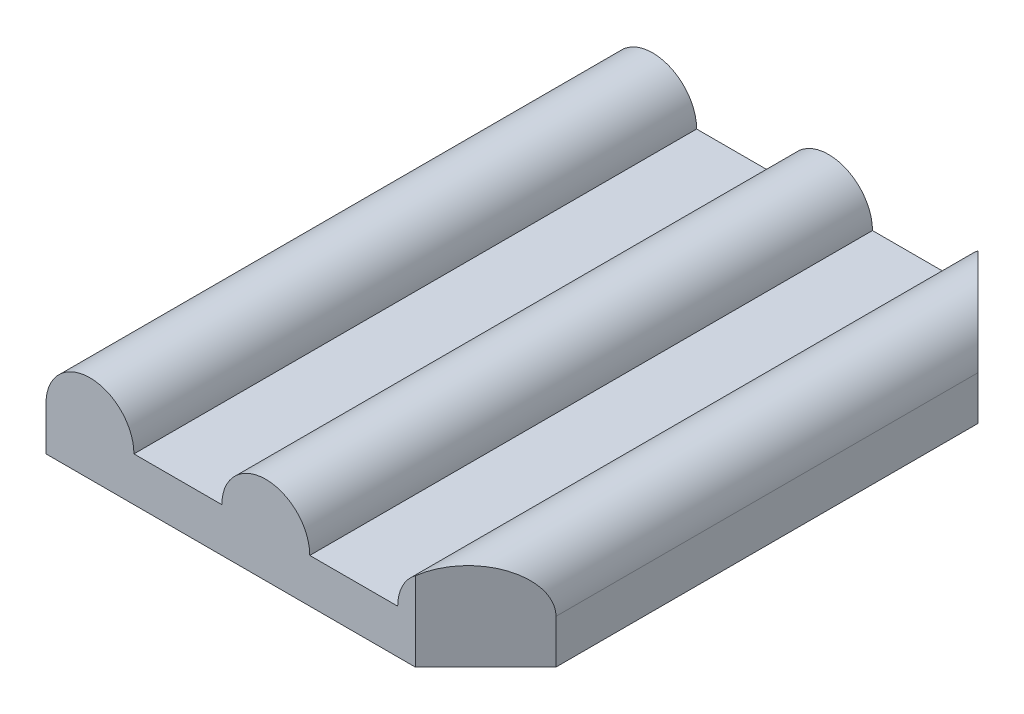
ISO-10303-21;
HEADER;
FILE_DESCRIPTION(('STEP AP214'),'2;1');
FILE_NAME('part.step','',(''),(''),'','','');
FILE_SCHEMA(('AUTOMOTIVE_DESIGN { 1 0 10303 214 1 1 1 1 }'));
ENDSEC;
DATA;
#1=APPLICATION_CONTEXT('core data for automotive mechanical design processes');
#2=APPLICATION_PROTOCOL_DEFINITION('international standard','automotive_design',2000,#1);
#3=PRODUCT_CONTEXT('',#1,'mechanical');
#4=PRODUCT('Part','Part','',(#3));
#5=PRODUCT_RELATED_PRODUCT_CATEGORY('part','',(#4));
#6=PRODUCT_DEFINITION_FORMATION('','',#4);
#7=PRODUCT_DEFINITION_CONTEXT('part definition',#1,'design');
#8=PRODUCT_DEFINITION('design','',#6,#7);
#9=PRODUCT_DEFINITION_SHAPE('','',#8);
#10=(LENGTH_UNIT() NAMED_UNIT(*) SI_UNIT(.MILLI.,.METRE.));
#11=(NAMED_UNIT(*) PLANE_ANGLE_UNIT() SI_UNIT($,.RADIAN.));
#12=(NAMED_UNIT(*) SI_UNIT($,.STERADIAN.) SOLID_ANGLE_UNIT());
#13=UNCERTAINTY_MEASURE_WITH_UNIT(LENGTH_MEASURE(1.E-05),#10,'distance_accuracy_value','');
#14=(GEOMETRIC_REPRESENTATION_CONTEXT(3) GLOBAL_UNCERTAINTY_ASSIGNED_CONTEXT((#13)) GLOBAL_UNIT_ASSIGNED_CONTEXT((#10,
#11,#12)) REPRESENTATION_CONTEXT('',''));
#15=CARTESIAN_POINT('',(0.,0.,0.));
#16=DIRECTION('',(0.,0.,1.));
#17=DIRECTION('',(1.,0.,0.));
#18=AXIS2_PLACEMENT_3D('',#15,#16,#17);
#19=CARTESIAN_POINT('',(10.,2.5,0.));
#20=DIRECTION('',(0.,0.,1.));
#21=DIRECTION('',(1.,0.,0.));
#22=AXIS2_PLACEMENT_3D('',#19,#20,#21);
#23=CYLINDRICAL_SURFACE('',#22,2.5);
#24=CARTESIAN_POINT('',(10.,2.5,30.5));
#25=DIRECTION('',(-0.707106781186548,0.,-0.707106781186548));
#26=DIRECTION('',(-0.707106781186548,0.,0.707106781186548));
#27=AXIS2_PLACEMENT_3D('',#24,#25,#26);
#28=ELLIPSE('',#27,3.53553390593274,2.5);
#29=CARTESIAN_POINT('',(8.5,4.5,32.));
#30=VERTEX_POINT('',#29);
#31=CARTESIAN_POINT('',(12.5,2.5,28.));
#32=VERTEX_POINT('',#31);
#33=EDGE_CURVE('E104',#30,#32,#28,.T.);
#34=ORIENTED_EDGE('',*,*,#33,.T.);
#35=DIRECTION('',(0.,0.,-1.));
#36=VECTOR('',#35,1.);
#37=CARTESIAN_POINT('',(12.5,2.5,0.));
#38=LINE('',#37,#36);
#39=CARTESIAN_POINT('',(12.5,2.5,4.));
#40=VERTEX_POINT('',#39);
#41=EDGE_CURVE('E102',#40,#32,#38,.F.);
#42=ORIENTED_EDGE('',*,*,#41,.F.);
#43=CARTESIAN_POINT('',(10.,2.5,1.5));
#44=DIRECTION('',(-0.707106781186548,0.,0.707106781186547));
#45=DIRECTION('',(0.707106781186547,0.,0.707106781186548));
#46=AXIS2_PLACEMENT_3D('',#43,#44,#45);
#47=ELLIPSE('',#46,3.53553390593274,2.5);
#48=CARTESIAN_POINT('',(8.5,4.5,0.));
#49=VERTEX_POINT('',#48);
#50=EDGE_CURVE('E19',#40,#49,#47,.T.);
#51=ORIENTED_EDGE('',*,*,#50,.T.);
#52=CARTESIAN_POINT('',(10.,2.5,0.));
#53=DIRECTION('',(0.,0.,1.));
#54=DIRECTION('',(1.,0.,0.));
#55=AXIS2_PLACEMENT_3D('',#52,#53,#54);
#56=CIRCLE('',#55,2.5);
#57=CARTESIAN_POINT('',(7.5,2.5,0.));
#58=VERTEX_POINT('',#57);
#59=EDGE_CURVE('E122',#49,#58,#56,.T.);
#60=ORIENTED_EDGE('',*,*,#59,.T.);
#61=DIRECTION('',(0.,0.,1.));
#62=VECTOR('',#61,1.);
#63=CARTESIAN_POINT('',(7.5,2.5,0.));
#64=LINE('',#63,#62);
#65=CARTESIAN_POINT('',(7.5,2.5,32.));
#66=VERTEX_POINT('',#65);
#67=EDGE_CURVE('E156',#66,#58,#64,.F.);
#68=ORIENTED_EDGE('',*,*,#67,.F.);
#69=CARTESIAN_POINT('',(10.,2.5,32.));
#70=DIRECTION('',(0.,0.,1.));
#71=DIRECTION('',(1.,0.,0.));
#72=AXIS2_PLACEMENT_3D('',#69,#70,#71);
#73=CIRCLE('',#72,2.5);
#74=EDGE_CURVE('E133',#30,#66,#73,.T.);
#75=ORIENTED_EDGE('',*,*,#74,.F.);
#76=EDGE_LOOP('',(#34,#42,#51,#60,#68,#75));
#77=FACE_BOUND('',#76,.T.);
#78=ADVANCED_FACE('F16',(#77),#23,.T.);
#79=CARTESIAN_POINT('',(2.5,2.5,0.));
#80=DIRECTION('',(0.,1.,0.));
#81=DIRECTION('',(0.,0.,1.));
#82=AXIS2_PLACEMENT_3D('',#79,#80,#81);
#83=PLANE('',#82);
#84=DIRECTION('',(1.,0.,0.));
#85=VECTOR('',#84,1.);
#86=CARTESIAN_POINT('',(0.,2.5,0.));
#87=LINE('',#86,#85);
#88=CARTESIAN_POINT('',(2.5,2.5,0.));
#89=VERTEX_POINT('',#88);
#90=EDGE_CURVE('E121',#58,#89,#87,.F.);
#91=ORIENTED_EDGE('',*,*,#90,.T.);
#92=DIRECTION('',(0.,0.,1.));
#93=VECTOR('',#92,1.);
#94=CARTESIAN_POINT('',(2.5,2.5,0.));
#95=LINE('',#94,#93);
#96=CARTESIAN_POINT('',(2.5,2.5,32.));
#97=VERTEX_POINT('',#96);
#98=EDGE_CURVE('E153',#97,#89,#95,.F.);
#99=ORIENTED_EDGE('',*,*,#98,.F.);
#100=DIRECTION('',(1.,0.,0.));
#101=VECTOR('',#100,1.);
#102=CARTESIAN_POINT('',(0.,2.5,32.));
#103=LINE('',#102,#101);
#104=EDGE_CURVE('E132',#66,#97,#103,.F.);
#105=ORIENTED_EDGE('',*,*,#104,.F.);
#106=ORIENTED_EDGE('',*,*,#67,.T.);
#107=EDGE_LOOP('',(#91,#99,#105,#106));
#108=FACE_BOUND('',#107,.T.);
#109=ADVANCED_FACE('F182',(#108),#83,.T.);
#110=CARTESIAN_POINT('',(0.,2.5,0.));
#111=DIRECTION('',(0.,0.,1.));
#112=DIRECTION('',(1.,0.,0.));
#113=AXIS2_PLACEMENT_3D('',#110,#111,#112);
#114=CYLINDRICAL_SURFACE('',#113,2.5);
#115=CARTESIAN_POINT('',(0.,2.5,0.));
#116=DIRECTION('',(0.,0.,1.));
#117=DIRECTION('',(1.,0.,0.));
#118=AXIS2_PLACEMENT_3D('',#115,#116,#117);
#119=CIRCLE('',#118,2.5);
#120=CARTESIAN_POINT('',(-2.5,2.5,0.));
#121=VERTEX_POINT('',#120);
#122=EDGE_CURVE('E119',#89,#121,#119,.T.);
#123=ORIENTED_EDGE('',*,*,#122,.T.);
#124=DIRECTION('',(0.,0.,1.));
#125=VECTOR('',#124,1.);
#126=CARTESIAN_POINT('',(-2.5,2.5,0.));
#127=LINE('',#126,#125);
#128=CARTESIAN_POINT('',(-2.5,2.5,32.));
#129=VERTEX_POINT('',#128);
#130=EDGE_CURVE('E150',#129,#121,#127,.F.);
#131=ORIENTED_EDGE('',*,*,#130,.F.);
#132=CARTESIAN_POINT('',(0.,2.5,32.));
#133=DIRECTION('',(0.,0.,1.));
#134=DIRECTION('',(1.,0.,0.));
#135=AXIS2_PLACEMENT_3D('',#132,#133,#134);
#136=CIRCLE('',#135,2.5);
#137=EDGE_CURVE('E129',#97,#129,#136,.T.);
#138=ORIENTED_EDGE('',*,*,#137,.F.);
#139=ORIENTED_EDGE('',*,*,#98,.T.);
#140=EDGE_LOOP('',(#123,#131,#138,#139));
#141=FACE_BOUND('',#140,.T.);
#142=ADVANCED_FACE('F185',(#141),#114,.T.);
#143=CARTESIAN_POINT('',(-7.5,2.5,0.));
#144=DIRECTION('',(0.,1.,0.));
#145=DIRECTION('',(0.,0.,1.));
#146=AXIS2_PLACEMENT_3D('',#143,#144,#145);
#147=PLANE('',#146);
#148=DIRECTION('',(1.,0.,0.));
#149=VECTOR('',#148,1.);
#150=CARTESIAN_POINT('',(0.,2.5,0.));
#151=LINE('',#150,#149);
#152=CARTESIAN_POINT('',(-7.5,2.5,0.));
#153=VERTEX_POINT('',#152);
#154=EDGE_CURVE('E118',#121,#153,#151,.F.);
#155=ORIENTED_EDGE('',*,*,#154,.T.);
#156=DIRECTION('',(0.,0.,1.));
#157=VECTOR('',#156,1.);
#158=CARTESIAN_POINT('',(-7.5,2.5,0.));
#159=LINE('',#158,#157);
#160=CARTESIAN_POINT('',(-7.5,2.5,32.));
#161=VERTEX_POINT('',#160);
#162=EDGE_CURVE('E100',#161,#153,#159,.F.);
#163=ORIENTED_EDGE('',*,*,#162,.F.);
#164=DIRECTION('',(1.,0.,0.));
#165=VECTOR('',#164,1.);
#166=CARTESIAN_POINT('',(0.,2.5,32.));
#167=LINE('',#166,#165);
#168=EDGE_CURVE('E128',#129,#161,#167,.F.);
#169=ORIENTED_EDGE('',*,*,#168,.F.);
#170=ORIENTED_EDGE('',*,*,#130,.T.);
#171=EDGE_LOOP('',(#155,#163,#169,#170));
#172=FACE_BOUND('',#171,.T.);
#173=ADVANCED_FACE('F189',(#172),#147,.T.);
#174=CARTESIAN_POINT('',(-10.,2.5,0.));
#175=DIRECTION('',(0.,0.,1.));
#176=DIRECTION('',(1.,0.,0.));
#177=AXIS2_PLACEMENT_3D('',#174,#175,#176);
#178=CYLINDRICAL_SURFACE('',#177,2.5);
#179=CARTESIAN_POINT('',(-10.,2.5,0.));
#180=DIRECTION('',(0.,0.,1.));
#181=DIRECTION('',(1.,0.,0.));
#182=AXIS2_PLACEMENT_3D('',#179,#180,#181);
#183=CIRCLE('',#182,2.5);
#184=CARTESIAN_POINT('',(-12.5,2.5,0.));
#185=VERTEX_POINT('',#184);
#186=EDGE_CURVE('E116',#153,#185,#183,.T.);
#187=ORIENTED_EDGE('',*,*,#186,.T.);
#188=DIRECTION('',(0.,0.,1.));
#189=VECTOR('',#188,1.);
#190=CARTESIAN_POINT('',(-12.5,2.5,0.));
#191=LINE('',#190,#189);
#192=CARTESIAN_POINT('',(-12.5,2.5,32.));
#193=VERTEX_POINT('',#192);
#194=EDGE_CURVE('E124',#193,#185,#191,.F.);
#195=ORIENTED_EDGE('',*,*,#194,.F.);
#196=CARTESIAN_POINT('',(-10.,2.5,32.));
#197=DIRECTION('',(0.,0.,1.));
#198=DIRECTION('',(1.,0.,0.));
#199=AXIS2_PLACEMENT_3D('',#196,#197,#198);
#200=CIRCLE('',#199,2.5);
#201=EDGE_CURVE('E125',#161,#193,#200,.T.);
#202=ORIENTED_EDGE('',*,*,#201,.F.);
#203=ORIENTED_EDGE('',*,*,#162,.T.);
#204=EDGE_LOOP('',(#187,#195,#202,#203));
#205=FACE_BOUND('',#204,.T.);
#206=ADVANCED_FACE('F194',(#205),#178,.T.);
#207=CARTESIAN_POINT('',(12.5,0.,4.));
#208=DIRECTION('',(-0.707106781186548,0.,0.707106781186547));
#209=DIRECTION('',(0.707106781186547,0.,0.707106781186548));
#210=AXIS2_PLACEMENT_3D('',#207,#208,#209);
#211=PLANE('',#210);
#212=DIRECTION('',(0.,1.,0.));
#213=VECTOR('',#212,1.);
#214=CARTESIAN_POINT('',(12.5,2.5,4.));
#215=LINE('',#214,#213);
#216=CARTESIAN_POINT('',(12.5,0.,4.));
#217=VERTEX_POINT('',#216);
#218=EDGE_CURVE('E94',#217,#40,#215,.T.);
#219=ORIENTED_EDGE('',*,*,#218,.F.);
#220=DIRECTION('',(0.707106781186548,0.,0.707106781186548));
#221=VECTOR('',#220,1.);
#222=CARTESIAN_POINT('',(8.5,0.,0.));
#223=LINE('',#222,#221);
#224=CARTESIAN_POINT('',(8.5,0.,0.));
#225=VERTEX_POINT('',#224);
#226=EDGE_CURVE('E142',#225,#217,#223,.T.);
#227=ORIENTED_EDGE('',*,*,#226,.F.);
#228=DIRECTION('',(0.,1.,0.));
#229=VECTOR('',#228,1.);
#230=CARTESIAN_POINT('',(8.5,1.95030096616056,0.));
#231=LINE('',#230,#229);
#232=EDGE_CURVE('E97',#225,#49,#231,.T.);
#233=ORIENTED_EDGE('',*,*,#232,.T.);
#234=ORIENTED_EDGE('',*,*,#50,.F.);
#235=EDGE_LOOP('',(#219,#227,#233,#234));
#236=FACE_BOUND('',#235,.T.);
#237=ADVANCED_FACE('F91',(#236),#211,.F.);
#238=CARTESIAN_POINT('',(12.5,2.5,0.));
#239=DIRECTION('',(1.,0.,0.));
#240=DIRECTION('',(0.,0.,-1.));
#241=AXIS2_PLACEMENT_3D('',#238,#239,#240);
#242=PLANE('',#241);
#243=DIRECTION('',(0.,1.,0.));
#244=VECTOR('',#243,1.);
#245=CARTESIAN_POINT('',(12.5,0.,28.));
#246=LINE('',#245,#244);
#247=CARTESIAN_POINT('',(12.5,0.,28.));
#248=VERTEX_POINT('',#247);
#249=EDGE_CURVE('E107',#32,#248,#246,.F.);
#250=ORIENTED_EDGE('',*,*,#249,.T.);
#251=DIRECTION('',(0.,0.,-1.));
#252=VECTOR('',#251,1.);
#253=CARTESIAN_POINT('',(12.5,0.,0.));
#254=LINE('',#253,#252);
#255=EDGE_CURVE('E111',#217,#248,#254,.F.);
#256=ORIENTED_EDGE('',*,*,#255,.F.);
#257=ORIENTED_EDGE('',*,*,#218,.T.);
#258=ORIENTED_EDGE('',*,*,#41,.T.);
#259=EDGE_LOOP('',(#250,#256,#257,#258));
#260=FACE_BOUND('',#259,.T.);
#261=ADVANCED_FACE('F109',(#260),#242,.T.);
#262=CARTESIAN_POINT('',(8.5,0.,32.));
#263=DIRECTION('',(-0.707106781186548,0.,-0.707106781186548));
#264=DIRECTION('',(-0.707106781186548,0.,0.707106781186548));
#265=AXIS2_PLACEMENT_3D('',#262,#263,#264);
#266=PLANE('',#265);
#267=DIRECTION('',(0.,1.,0.));
#268=VECTOR('',#267,1.);
#269=CARTESIAN_POINT('',(8.5,1.95030096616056,32.));
#270=LINE('',#269,#268);
#271=CARTESIAN_POINT('',(8.5,0.,32.));
#272=VERTEX_POINT('',#271);
#273=EDGE_CURVE('E135',#272,#30,#270,.T.);
#274=ORIENTED_EDGE('',*,*,#273,.F.);
#275=DIRECTION('',(-0.707106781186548,0.,0.707106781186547));
#276=VECTOR('',#275,1.);
#277=CARTESIAN_POINT('',(12.5,0.,28.));
#278=LINE('',#277,#276);
#279=EDGE_CURVE('E163',#248,#272,#278,.T.);
#280=ORIENTED_EDGE('',*,*,#279,.F.);
#281=ORIENTED_EDGE('',*,*,#249,.F.);
#282=ORIENTED_EDGE('',*,*,#33,.F.);
#283=EDGE_LOOP('',(#274,#280,#281,#282));
#284=FACE_BOUND('',#283,.T.);
#285=ADVANCED_FACE('F198',(#284),#266,.F.);
#286=CARTESIAN_POINT('',(0.,1.95030096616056,32.));
#287=DIRECTION('',(0.,0.,1.));
#288=DIRECTION('',(1.,0.,0.));
#289=AXIS2_PLACEMENT_3D('',#286,#287,#288);
#290=PLANE('',#289);
#291=DIRECTION('',(0.,1.,0.));
#292=VECTOR('',#291,1.);
#293=CARTESIAN_POINT('',(-12.5,0.,32.));
#294=LINE('',#293,#292);
#295=CARTESIAN_POINT('',(-12.5,0.,32.));
#296=VERTEX_POINT('',#295);
#297=EDGE_CURVE('E127',#296,#193,#294,.T.);
#298=ORIENTED_EDGE('',*,*,#297,.F.);
#299=DIRECTION('',(1.,0.,0.));
#300=VECTOR('',#299,1.);
#301=CARTESIAN_POINT('',(12.5,0.,32.));
#302=LINE('',#301,#300);
#303=EDGE_CURVE('E147',#272,#296,#302,.F.);
#304=ORIENTED_EDGE('',*,*,#303,.F.);
#305=ORIENTED_EDGE('',*,*,#273,.T.);
#306=ORIENTED_EDGE('',*,*,#74,.T.);
#307=ORIENTED_EDGE('',*,*,#104,.T.);
#308=ORIENTED_EDGE('',*,*,#137,.T.);
#309=ORIENTED_EDGE('',*,*,#168,.T.);
#310=ORIENTED_EDGE('',*,*,#201,.T.);
#311=EDGE_LOOP('',(#298,#304,#305,#306,#307,#308,#309,#310));
#312=FACE_BOUND('',#311,.T.);
#313=ADVANCED_FACE('F179',(#312),#290,.T.);
#314=CARTESIAN_POINT('',(-12.5,0.,0.));
#315=DIRECTION('',(-1.,0.,0.));
#316=DIRECTION('',(0.,0.,1.));
#317=AXIS2_PLACEMENT_3D('',#314,#315,#316);
#318=PLANE('',#317);
#319=DIRECTION('',(0.,1.,0.));
#320=VECTOR('',#319,1.);
#321=CARTESIAN_POINT('',(-12.5,1.95030096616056,0.));
#322=LINE('',#321,#320);
#323=CARTESIAN_POINT('',(-12.5,0.,0.));
#324=VERTEX_POINT('',#323);
#325=EDGE_CURVE('E34',#185,#324,#322,.F.);
#326=ORIENTED_EDGE('',*,*,#325,.T.);
#327=DIRECTION('',(0.,0.,-1.));
#328=VECTOR('',#327,1.);
#329=CARTESIAN_POINT('',(-12.5,0.,0.));
#330=LINE('',#329,#328);
#331=EDGE_CURVE('E25',#296,#324,#330,.T.);
#332=ORIENTED_EDGE('',*,*,#331,.F.);
#333=ORIENTED_EDGE('',*,*,#297,.T.);
#334=ORIENTED_EDGE('',*,*,#194,.T.);
#335=EDGE_LOOP('',(#326,#332,#333,#334));
#336=FACE_BOUND('',#335,.T.);
#337=ADVANCED_FACE('F196',(#336),#318,.T.);
#338=CARTESIAN_POINT('',(0.,1.95030096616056,0.));
#339=DIRECTION('',(0.,0.,1.));
#340=DIRECTION('',(1.,0.,0.));
#341=AXIS2_PLACEMENT_3D('',#338,#339,#340);
#342=PLANE('',#341);
#343=DIRECTION('',(1.,0.,0.));
#344=VECTOR('',#343,1.);
#345=CARTESIAN_POINT('',(12.5,0.,0.));
#346=LINE('',#345,#344);
#347=EDGE_CURVE('E11',#324,#225,#346,.T.);
#348=ORIENTED_EDGE('',*,*,#347,.F.);
#349=ORIENTED_EDGE('',*,*,#325,.F.);
#350=ORIENTED_EDGE('',*,*,#186,.F.);
#351=ORIENTED_EDGE('',*,*,#154,.F.);
#352=ORIENTED_EDGE('',*,*,#122,.F.);
#353=ORIENTED_EDGE('',*,*,#90,.F.);
#354=ORIENTED_EDGE('',*,*,#59,.F.);
#355=ORIENTED_EDGE('',*,*,#232,.F.);
#356=EDGE_LOOP('',(#348,#349,#350,#351,#352,#353,#354,#355));
#357=FACE_BOUND('',#356,.T.);
#358=ADVANCED_FACE('F168',(#357),#342,.F.);
#359=CARTESIAN_POINT('',(12.5,0.,0.));
#360=DIRECTION('',(0.,-1.,0.));
#361=DIRECTION('',(0.,0.,-1.));
#362=AXIS2_PLACEMENT_3D('',#359,#360,#361);
#363=PLANE('',#362);
#364=ORIENTED_EDGE('',*,*,#331,.T.);
#365=ORIENTED_EDGE('',*,*,#347,.T.);
#366=ORIENTED_EDGE('',*,*,#226,.T.);
#367=ORIENTED_EDGE('',*,*,#255,.T.);
#368=ORIENTED_EDGE('',*,*,#279,.T.);
#369=ORIENTED_EDGE('',*,*,#303,.T.);
#370=EDGE_LOOP('',(#364,#365,#366,#367,#368,#369));
#371=FACE_BOUND('',#370,.T.);
#372=ADVANCED_FACE('F166',(#371),#363,.T.);
#373=CLOSED_SHELL('',(#78,#109,#142,#173,#206,#237,#261,#285,#313,#337,#358,#372));
#374=MANIFOLD_SOLID_BREP('B1',#373);
#375=ADVANCED_BREP_SHAPE_REPRESENTATION('',(#18,#374),#14);
#376=SHAPE_DEFINITION_REPRESENTATION(#9,#375);
ENDSEC;
END-ISO-10303-21;
